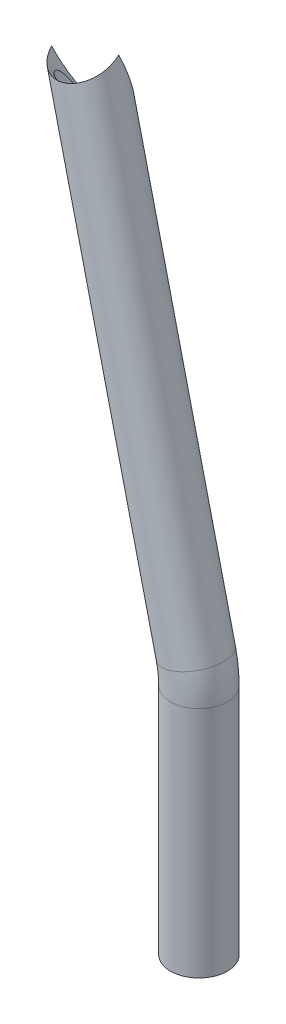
ISO-10303-21;
HEADER;
FILE_DESCRIPTION(('STEP AP214'),'2;1');
FILE_NAME('part.step','',(''),(''),'','','');
FILE_SCHEMA(('AUTOMOTIVE_DESIGN { 1 0 10303 214 1 1 1 1 }'));
ENDSEC;
DATA;
#1=APPLICATION_CONTEXT('core data for automotive mechanical design processes');
#2=APPLICATION_PROTOCOL_DEFINITION('international standard','automotive_design',2000,#1);
#3=PRODUCT_CONTEXT('',#1,'mechanical');
#4=PRODUCT('Part','Part','',(#3));
#5=PRODUCT_RELATED_PRODUCT_CATEGORY('part','',(#4));
#6=PRODUCT_DEFINITION_FORMATION('','',#4);
#7=PRODUCT_DEFINITION_CONTEXT('part definition',#1,'design');
#8=PRODUCT_DEFINITION('design','',#6,#7);
#9=PRODUCT_DEFINITION_SHAPE('','',#8);
#10=(LENGTH_UNIT() NAMED_UNIT(*) SI_UNIT(.MILLI.,.METRE.));
#11=(NAMED_UNIT(*) PLANE_ANGLE_UNIT() SI_UNIT($,.RADIAN.));
#12=(NAMED_UNIT(*) SI_UNIT($,.STERADIAN.) SOLID_ANGLE_UNIT());
#13=UNCERTAINTY_MEASURE_WITH_UNIT(LENGTH_MEASURE(1.E-05),#10,'distance_accuracy_value','');
#14=(GEOMETRIC_REPRESENTATION_CONTEXT(3) GLOBAL_UNCERTAINTY_ASSIGNED_CONTEXT((#13)) GLOBAL_UNIT_ASSIGNED_CONTEXT((#10,
#11,#12)) REPRESENTATION_CONTEXT('',''));
#15=CARTESIAN_POINT('',(0.,0.,0.));
#16=DIRECTION('',(0.,0.,1.));
#17=DIRECTION('',(1.,0.,0.));
#18=AXIS2_PLACEMENT_3D('',#15,#16,#17);
#19=CARTESIAN_POINT('',(58.3805106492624,-246.153846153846,0.));
#20=DIRECTION('',(-0.230769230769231,0.97300851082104,0.));
#21=DIRECTION('',(-0.97300851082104,-0.230769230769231,0.));
#22=AXIS2_PLACEMENT_3D('',#19,#20,#21);
#23=CYLINDRICAL_SURFACE('',#22,15.);
#24=CARTESIAN_POINT('',(58.3805106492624,-246.153846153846,0.));
#25=DIRECTION('',(-0.230769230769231,0.97300851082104,0.));
#26=DIRECTION('',(0.,0.,1.));
#27=AXIS2_PLACEMENT_3D('',#24,#25,#26);
#28=CIRCLE('',#27,15.);
#29=CARTESIAN_POINT('',(72.975638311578,-242.692307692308,0.));
#30=VERTEX_POINT('',#29);
#31=EDGE_CURVE('E11',#30,#30,#28,.T.);
#32=ORIENTED_EDGE('',*,*,#31,.T.);
#33=EDGE_LOOP('',(#32));
#34=FACE_BOUND('',#33,.T.);
#35=CARTESIAN_POINT('',(0.,0.,0.));
#36=DIRECTION('',(-0.298010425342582,0.327244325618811,-0.896716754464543));
#37=DIRECTION('',(-0.125145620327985,0.917898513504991,0.376564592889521));
#38=AXIS2_PLACEMENT_3D('',#35,#36,#37);
#39=ELLIPSE('',#38,38.7413552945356,15.);
#40=CARTESIAN_POINT('',(-14.1948540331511,-3.36660523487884,3.48885198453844));
#41=VERTEX_POINT('',#40);
#42=CARTESIAN_POINT('',(14.1948540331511,3.36660523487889,-3.48885198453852));
#43=VERTEX_POINT('',#42);
#44=EDGE_CURVE('E46',#41,#43,#39,.F.);
#45=ORIENTED_EDGE('',*,*,#44,.T.);
#46=CARTESIAN_POINT('',(0.,0.,0.));
#47=DIRECTION('',(-0.125145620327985,0.917898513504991,0.376564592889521));
#48=DIRECTION('',(-0.298010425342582,0.327244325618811,-0.896716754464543));
#49=AXIS2_PLACEMENT_3D('',#46,#47,#48);
#50=ELLIPSE('',#49,16.268930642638,15.);
#51=EDGE_CURVE('E44',#43,#41,#50,.F.);
#52=ORIENTED_EDGE('',*,*,#51,.T.);
#53=EDGE_LOOP('',(#45,#52));
#54=FACE_BOUND('',#53,.T.);
#55=ADVANCED_FACE('F31',(#34,#54),#23,.T.);
#56=CARTESIAN_POINT('',(58.3805106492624,-246.153846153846,0.));
#57=DIRECTION('',(-0.230769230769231,0.97300851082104,0.));
#58=DIRECTION('',(-0.97300851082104,-0.230769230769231,0.));
#59=AXIS2_PLACEMENT_3D('',#56,#57,#58);
#60=CYLINDRICAL_SURFACE('',#59,13.);
#61=CARTESIAN_POINT('',(58.3805106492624,-246.153846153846,0.));
#62=DIRECTION('',(-0.230769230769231,0.97300851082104,0.));
#63=DIRECTION('',(0.,0.,1.));
#64=AXIS2_PLACEMENT_3D('',#61,#62,#63);
#65=CIRCLE('',#64,13.);
#66=CARTESIAN_POINT('',(71.0296212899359,-243.153846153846,0.));
#67=VERTEX_POINT('',#66);
#68=EDGE_CURVE('E38',#67,#67,#65,.T.);
#69=ORIENTED_EDGE('',*,*,#68,.F.);
#70=EDGE_LOOP('',(#69));
#71=FACE_BOUND('',#70,.T.);
#72=CARTESIAN_POINT('',(-9.35607137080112,-16.8846726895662,0.));
#73=CARTESIAN_POINT('',(-9.25164398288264,-17.3250074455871,-0.309104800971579));
#74=CARTESIAN_POINT('',(-9.13534416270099,-17.767866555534,-0.610672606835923));
#75=CARTESIAN_POINT('',(-8.88233934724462,-18.6551858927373,-1.20279704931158));
#76=CARTESIAN_POINT('',(-8.7456281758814,-19.0996465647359,-1.49335031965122));
#77=CARTESIAN_POINT('',(-8.45343297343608,-19.9882526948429,-2.06669628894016));
#78=CARTESIAN_POINT('',(-8.29792519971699,-20.432397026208,-2.34947860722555));
#79=CARTESIAN_POINT('',(-7.96916656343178,-21.3178058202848,-2.90902688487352));
#80=CARTESIAN_POINT('',(-7.79591773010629,-21.7590706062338,-3.18579352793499));
#81=CARTESIAN_POINT('',(-7.43081976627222,-22.6395008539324,-3.7364708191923));
#82=CARTESIAN_POINT('',(-7.23887240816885,-23.0786409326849,-4.01035697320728));
#83=CARTESIAN_POINT('',(-6.83679636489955,-23.9506115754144,-4.55490929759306));
#84=CARTESIAN_POINT('',(-6.62666636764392,-24.3834416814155,-4.82557523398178));
#85=CARTESIAN_POINT('',(-6.18759669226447,-25.2403557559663,-5.36422562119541));
#86=CARTESIAN_POINT('',(-5.95867926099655,-25.6644493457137,-5.63221283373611));
#87=CARTESIAN_POINT('',(-5.48045788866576,-26.5020643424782,-6.16636841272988));
#88=CARTESIAN_POINT('',(-5.2311571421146,-26.9155873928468,-6.43253705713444));
#89=CARTESIAN_POINT('',(-4.68451038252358,-27.7693743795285,-6.98958538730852));
#90=CARTESIAN_POINT('',(-4.38485052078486,-28.2082691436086,-7.2803212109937));
#91=CARTESIAN_POINT('',(-3.91231584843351,-28.8507532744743,-7.7151938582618));
#92=CARTESIAN_POINT('',(-3.75089515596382,-29.0623520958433,-7.86000318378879));
#93=CARTESIAN_POINT('',(-3.41979518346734,-29.4793549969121,-8.14913045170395));
#94=CARTESIAN_POINT('',(-3.25011603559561,-29.6847591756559,-8.29344840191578));
#95=CARTESIAN_POINT('',(-2.90315695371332,-30.0868185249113,-8.5803999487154));
#96=CARTESIAN_POINT('',(-2.72594357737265,-30.2835277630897,-8.7230380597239));
#97=CARTESIAN_POINT('',(-2.36198252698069,-30.6685800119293,-9.00755709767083));
#98=CARTESIAN_POINT('',(-2.17523384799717,-30.8569221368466,-9.14943794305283));
#99=CARTESIAN_POINT('',(-1.79164786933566,-31.2233850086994,-9.43195470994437));
#100=CARTESIAN_POINT('',(-1.59482444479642,-31.4015191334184,-9.57259204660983));
#101=CARTESIAN_POINT('',(-1.18999968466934,-31.7457925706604,-9.85235406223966));
#102=CARTESIAN_POINT('',(-0.982002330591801,-31.9119361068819,-9.99147925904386));
#103=CARTESIAN_POINT('',(-0.620209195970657,-32.1804386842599,-10.2248036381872));
#104=CARTESIAN_POINT('',(-0.469597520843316,-32.2866055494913,-10.3195610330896));
#105=CARTESIAN_POINT('',(-0.162271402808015,-32.4909777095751,-10.5077737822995));
#106=CARTESIAN_POINT('',(-0.00555720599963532,-32.5891833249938,-10.6012291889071));
#107=CARTESIAN_POINT('',(0.314515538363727,-32.7765532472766,-10.786613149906));
#108=CARTESIAN_POINT('',(0.477883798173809,-32.8657036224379,-10.8785391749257));
#109=CARTESIAN_POINT('',(0.811138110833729,-33.0333016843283,-11.0601771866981));
#110=CARTESIAN_POINT('',(0.981024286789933,-33.1117491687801,-11.1498891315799));
#111=CARTESIAN_POINT('',(1.50487299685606,-33.330244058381,-11.4169331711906));
#112=CARTESIAN_POINT('',(1.86955914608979,-33.45133423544,-11.5901344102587));
#113=CARTESIAN_POINT('',(2.43393422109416,-33.5823797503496,-11.8353536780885));
#114=CARTESIAN_POINT('',(2.62480704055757,-33.6176227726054,-11.914611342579));
#115=CARTESIAN_POINT('',(3.01147035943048,-33.6692105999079,-12.0671818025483));
#116=CARTESIAN_POINT('',(3.2072587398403,-33.6855634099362,-12.1404971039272));
#117=CARTESIAN_POINT('',(3.55106836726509,-33.6959626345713,-12.2618779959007));
#118=CARTESIAN_POINT('',(3.69838379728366,-33.6946748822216,-12.3115784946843));
#119=CARTESIAN_POINT('',(3.99386654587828,-33.6801178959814,-12.4064617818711));
#120=CARTESIAN_POINT('',(4.14203366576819,-33.6668513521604,-12.4516455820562));
#121=CARTESIAN_POINT('',(4.43812832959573,-33.6280428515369,-12.5370107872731));
#122=CARTESIAN_POINT('',(4.58605595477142,-33.6025068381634,-12.5771946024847));
#123=CARTESIAN_POINT('',(4.8806444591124,-33.5391730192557,-12.6522175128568));
#124=CARTESIAN_POINT('',(5.02730529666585,-33.50137481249,-12.6870564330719));
#125=CARTESIAN_POINT('',(5.31813944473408,-33.4138928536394,-12.7511235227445));
#126=CARTESIAN_POINT('',(5.46231478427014,-33.3642193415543,-12.7803564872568));
#127=CARTESIAN_POINT('',(5.74737641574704,-33.2535830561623,-12.8331737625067));
#128=CARTESIAN_POINT('',(5.88826153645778,-33.1926163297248,-12.8567560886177));
#129=CARTESIAN_POINT('',(6.16594879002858,-33.060230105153,-12.8983304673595));
#130=CARTESIAN_POINT('',(6.30274903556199,-32.9888058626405,-12.9163199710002));
#131=CARTESIAN_POINT('',(6.57162620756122,-32.8365080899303,-12.946884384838));
#132=CARTESIAN_POINT('',(6.70370192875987,-32.7556321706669,-12.9594579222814));
#133=CARTESIAN_POINT('',(7.01261428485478,-32.5526972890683,-12.9833121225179));
#134=CARTESIAN_POINT('',(7.18710201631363,-32.4267725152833,-12.9922303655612));
#135=CARTESIAN_POINT('',(7.52578834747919,-32.1614796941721,-13.001092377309));
#136=CARTESIAN_POINT('',(7.68998229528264,-32.0221056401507,-13.0010321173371));
#137=CARTESIAN_POINT('',(8.00841551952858,-31.7320780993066,-12.9928895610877));
#138=CARTESIAN_POINT('',(8.16263422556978,-31.5814026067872,-12.9847912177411));
#139=CARTESIAN_POINT('',(8.46110322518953,-31.2711208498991,-12.9614814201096));
#140=CARTESIAN_POINT('',(8.60535492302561,-31.1115158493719,-12.9462709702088));
#141=CARTESIAN_POINT('',(8.98224413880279,-30.6707358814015,-12.896744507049));
#142=CARTESIAN_POINT('',(9.20606702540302,-30.3826696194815,-12.8565077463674));
#143=CARTESIAN_POINT('',(9.62986109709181,-29.7917688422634,-12.7613872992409));
#144=CARTESIAN_POINT('',(9.82981396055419,-29.4889232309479,-12.7064924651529));
#145=CARTESIAN_POINT('',(10.209132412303,-28.8722772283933,-12.5845720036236));
#146=CARTESIAN_POINT('',(10.3884599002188,-28.5584579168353,-12.5175244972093));
#147=CARTESIAN_POINT('',(10.7287223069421,-27.923442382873,-12.3733600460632));
#148=CARTESIAN_POINT('',(10.8896614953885,-27.6022478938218,-12.2962454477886));
#149=CARTESIAN_POINT('',(11.2045475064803,-26.9352228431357,-12.1285658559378));
#150=CARTESIAN_POINT('',(11.3575098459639,-26.5890628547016,-12.0374737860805));
#151=CARTESIAN_POINT('',(11.6476283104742,-25.8924037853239,-11.8469075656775));
#152=CARTESIAN_POINT('',(11.7847808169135,-25.5419037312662,-11.7474315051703));
#153=CARTESIAN_POINT('',(12.0451895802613,-24.8375805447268,-11.5409677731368));
#154=CARTESIAN_POINT('',(12.1684322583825,-24.4837545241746,-11.433972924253));
#155=CARTESIAN_POINT('',(12.4023700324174,-23.7741096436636,-11.2132615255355));
#156=CARTESIAN_POINT('',(12.5130660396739,-23.4182909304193,-11.0995454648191));
#157=CARTESIAN_POINT('',(12.7235867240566,-22.7040034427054,-10.8654228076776));
#158=CARTESIAN_POINT('',(12.8233674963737,-22.3455297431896,-10.7449919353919));
#159=CARTESIAN_POINT('',(13.0126317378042,-21.6279206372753,-10.4981736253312));
#160=CARTESIAN_POINT('',(13.1021150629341,-21.2687852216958,-10.3717861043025));
#161=CARTESIAN_POINT('',(13.2716346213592,-20.5506126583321,-10.1133253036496));
#162=CARTESIAN_POINT('',(13.3516769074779,-20.1915755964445,-9.98125574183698));
#163=CARTESIAN_POINT('',(13.5031567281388,-19.4738298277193,-9.71140635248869));
#164=CARTESIAN_POINT('',(13.5745940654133,-19.1151211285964,-9.57362639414));
#165=CARTESIAN_POINT('',(13.7215076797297,-18.3348899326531,-9.26732348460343));
#166=CARTESIAN_POINT('',(13.7954510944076,-17.9135166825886,-9.09768377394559));
#167=CARTESIAN_POINT('',(13.9332835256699,-17.0725709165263,-8.7500372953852));
#168=CARTESIAN_POINT('',(13.9971722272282,-16.6529984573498,-8.57203026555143));
#169=CARTESIAN_POINT('',(14.1157665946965,-15.8160297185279,-8.20681690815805));
#170=CARTESIAN_POINT('',(14.1704625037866,-15.3986362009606,-8.01960107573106));
#171=CARTESIAN_POINT('',(14.2712921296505,-14.5674539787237,-7.63515813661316));
#172=CARTESIAN_POINT('',(14.3174262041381,-14.1536651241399,-7.43793144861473));
#173=CARTESIAN_POINT('',(14.4015410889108,-13.3328588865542,-7.03298278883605));
#174=CARTESIAN_POINT('',(14.439559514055,-12.9258187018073,-6.82531500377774));
#175=CARTESIAN_POINT('',(14.5082204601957,-12.1180874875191,-6.39659666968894));
#176=CARTESIAN_POINT('',(14.5388617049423,-11.7173975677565,-6.17554381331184));
#177=CARTESIAN_POINT('',(14.5930752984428,-10.9254769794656,-5.7177189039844));
#178=CARTESIAN_POINT('',(14.6166596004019,-10.5342313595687,-5.48097427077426));
#179=CARTESIAN_POINT('',(14.6569777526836,-9.76409037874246,-4.98777628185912));
#180=CARTESIAN_POINT('',(14.6737148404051,-9.38518925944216,-4.73133230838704));
#181=CARTESIAN_POINT('',(14.6955187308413,-8.77344231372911,-4.2869838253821));
#182=CARTESIAN_POINT('',(14.7026198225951,-8.53553032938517,-4.10616672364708));
#183=CARTESIAN_POINT('',(14.7135627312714,-8.06934550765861,-3.73226097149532));
#184=CARTESIAN_POINT('',(14.7174041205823,-7.84107393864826,-3.53917071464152));
#185=CARTESIAN_POINT('',(14.7213953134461,-7.39746272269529,-3.13936680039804));
#186=CARTESIAN_POINT('',(14.7215522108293,-7.18209902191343,-2.93268009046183));
#187=CARTESIAN_POINT('',(14.717480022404,-6.76748879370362,-2.50372152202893));
#188=CARTESIAN_POINT('',(14.7132523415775,-6.56823712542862,-2.28145467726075));
#189=CARTESIAN_POINT('',(14.7009233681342,-6.23384316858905,-1.87349750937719));
#190=CARTESIAN_POINT('',(14.6939414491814,-6.09451897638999,-1.69120677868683));
#191=CARTESIAN_POINT('',(14.6760588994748,-5.83011865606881,-1.31672241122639));
#192=CARTESIAN_POINT('',(14.6651587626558,-5.70504073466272,-1.12453002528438));
#193=CARTESIAN_POINT('',(14.63865612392,-5.47131874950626,-0.731037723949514));
#194=CARTESIAN_POINT('',(14.6230603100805,-5.3626516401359,-0.529751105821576));
#195=CARTESIAN_POINT('',(14.5862754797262,-5.16313397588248,-0.119002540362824));
#196=CARTESIAN_POINT('',(14.5650865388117,-5.07228318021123,0.090459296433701));
#197=CARTESIAN_POINT('',(14.5161590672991,-4.90903843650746,0.516365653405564));
#198=CARTESIAN_POINT('',(14.488403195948,-4.83669442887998,0.732827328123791));
#199=CARTESIAN_POINT('',(14.4255524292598,-4.71073881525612,1.17007617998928));
#200=CARTESIAN_POINT('',(14.3904573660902,-4.6571276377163,1.39086345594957));
#201=CARTESIAN_POINT('',(14.312169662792,-4.56766209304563,1.8350158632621));
#202=CARTESIAN_POINT('',(14.2689615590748,-4.53184211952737,2.05838514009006));
#203=CARTESIAN_POINT('',(14.1739657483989,-4.47659259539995,2.50531270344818));
#204=CARTESIAN_POINT('',(14.1221767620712,-4.45716549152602,2.72887101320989));
#205=CARTESIAN_POINT('',(13.9926289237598,-4.42919137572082,3.24182384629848));
#206=CARTESIAN_POINT('',(13.9117506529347,-4.42570248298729,3.53070995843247));
#207=CARTESIAN_POINT('',(13.7342591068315,-4.43915015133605,4.10311775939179));
#208=CARTESIAN_POINT('',(13.6376406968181,-4.45609338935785,4.38663766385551));
#209=CARTESIAN_POINT('',(13.4283156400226,-4.50649251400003,4.94647765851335));
#210=CARTESIAN_POINT('',(13.3155917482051,-4.53996619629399,5.22278965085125));
#211=CARTESIAN_POINT('',(13.0740828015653,-4.62001037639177,5.76628288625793));
#212=CARTESIAN_POINT('',(12.9452989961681,-4.66657985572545,6.03346483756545));
#213=CARTESIAN_POINT('',(12.6678084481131,-4.77143000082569,6.56498880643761));
#214=CARTESIAN_POINT('',(12.518635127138,-4.830009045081,6.82902798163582));
#215=CARTESIAN_POINT('',(12.2036035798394,-4.95538694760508,7.34490463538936));
#216=CARTESIAN_POINT('',(12.0377452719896,-5.02218584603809,7.59674205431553));
#217=CARTESIAN_POINT('',(11.6897636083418,-5.16182069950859,8.08702186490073));
#218=CARTESIAN_POINT('',(11.5076456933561,-5.23465463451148,8.32546869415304));
#219=CARTESIAN_POINT('',(11.127592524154,-5.38456730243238,8.78799587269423));
#220=CARTESIAN_POINT('',(10.9296564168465,-5.46164626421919,9.01207544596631));
#221=CARTESIAN_POINT('',(10.4809151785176,-5.63287816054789,9.48448616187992));
#222=CARTESIAN_POINT('',(10.2270666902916,-5.72757263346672,9.72974232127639));
#223=CARTESIAN_POINT('',(9.6993513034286,-5.91857370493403,10.1970368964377));
#224=CARTESIAN_POINT('',(9.42548221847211,-6.01488047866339,10.4190727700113));
#225=CARTESIAN_POINT('',(8.85917223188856,-6.20730694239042,10.8384094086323));
#226=CARTESIAN_POINT('',(8.56672433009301,-6.30342654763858,11.0357007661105));
#227=CARTESIAN_POINT('',(7.96516424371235,-6.49388103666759,11.4039723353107));
#228=CARTESIAN_POINT('',(7.65605263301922,-6.58821598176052,11.574953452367));
#229=CARTESIAN_POINT('',(7.0240595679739,-6.77354355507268,11.8888748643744));
#230=CARTESIAN_POINT('',(6.70121773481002,-6.8645445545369,12.0318899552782));
#231=CARTESIAN_POINT('',(6.04322758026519,-7.04240413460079,12.289348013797));
#232=CARTESIAN_POINT('',(5.70807917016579,-7.12926268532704,12.403790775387));
#233=CARTESIAN_POINT('',(5.02795584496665,-7.29798161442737,12.6032059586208));
#234=CARTESIAN_POINT('',(4.68298231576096,-7.37984269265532,12.6881825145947));
#235=CARTESIAN_POINT('',(3.9857362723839,-7.5379680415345,12.8280532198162));
#236=CARTESIAN_POINT('',(3.63346387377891,-7.61423240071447,12.8829478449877));
#237=CARTESIAN_POINT('',(2.93176606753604,-7.75925081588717,12.9614474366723));
#238=CARTESIAN_POINT('',(2.58243719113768,-7.82812930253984,12.9856876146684));
#239=CARTESIAN_POINT('',(1.88188905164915,-7.9600644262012,13.0048768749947));
#240=CARTESIAN_POINT('',(1.53066981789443,-8.02312115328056,12.9998264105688));
#241=CARTESIAN_POINT('',(0.828969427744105,-8.14354850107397,12.9605528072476));
#242=CARTESIAN_POINT('',(0.478488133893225,-8.20092029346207,12.926335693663));
#243=CARTESIAN_POINT('',(-0.219272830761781,-8.31041961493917,12.8290519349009));
#244=CARTESIAN_POINT('',(-0.566552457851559,-8.36254707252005,12.7659848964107));
#245=CARTESIAN_POINT('',(-1.25937461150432,-8.46287081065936,12.6105959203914));
#246=CARTESIAN_POINT('',(-1.60485087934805,-8.51101480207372,12.5179448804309));
#247=CARTESIAN_POINT('',(-2.28739652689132,-8.60383141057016,12.3042708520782));
#248=CARTESIAN_POINT('',(-2.62446573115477,-8.6485039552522,12.1832472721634));
#249=CARTESIAN_POINT('',(-3.28819485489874,-8.73604233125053,11.9133701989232));
#250=CARTESIAN_POINT('',(-3.61483616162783,-8.77890497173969,11.7644698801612));
#251=CARTESIAN_POINT('',(-4.25448048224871,-8.86490232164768,11.4398590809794));
#252=CARTESIAN_POINT('',(-4.5674836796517,-8.90803702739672,11.2641489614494));
#253=CARTESIAN_POINT('',(-5.18440866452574,-8.99851350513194,10.8824005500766));
#254=CARTESIAN_POINT('',(-5.48793291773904,-9.04593133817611,10.6757362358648));
#255=CARTESIAN_POINT('',(-6.0746024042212,-9.14810666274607,10.2366106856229));
#256=CARTESIAN_POINT('',(-6.35774201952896,-9.20286616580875,10.0041423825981));
#257=CARTESIAN_POINT('',(-6.89889609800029,-9.32472286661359,9.51608628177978));
#258=CARTESIAN_POINT('',(-7.15698755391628,-9.39178029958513,9.26057431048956));
#259=CARTESIAN_POINT('',(-7.64448106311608,-9.54468284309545,8.72874117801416));
#260=CARTESIAN_POINT('',(-7.87390866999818,-9.63051102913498,8.45243890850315));
#261=CARTESIAN_POINT('',(-8.2163831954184,-9.78946154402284,7.9944518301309));
#262=CARTESIAN_POINT('',(-8.33997160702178,-9.85452720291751,7.8177970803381));
#263=CARTESIAN_POINT('',(-8.57352211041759,-9.99572839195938,7.45999418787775));
#264=CARTESIAN_POINT('',(-8.68348905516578,-10.0718599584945,7.27884767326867));
#265=CARTESIAN_POINT('',(-8.88865078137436,-10.2361859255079,6.9142377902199));
#266=CARTESIAN_POINT('',(-8.98387616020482,-10.3243546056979,6.73078009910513));
#267=CARTESIAN_POINT('',(-9.15921986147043,-10.513499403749,6.36322838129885));
#268=CARTESIAN_POINT('',(-9.2393380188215,-10.6144756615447,6.1791343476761));
#269=CARTESIAN_POINT('',(-9.38436535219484,-10.8292300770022,5.81231967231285));
#270=CARTESIAN_POINT('',(-9.44926807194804,-10.9430136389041,5.6295996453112));
#271=CARTESIAN_POINT('',(-9.56424814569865,-11.1826346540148,5.26745563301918));
#272=CARTESIAN_POINT('',(-9.61432523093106,-11.3084723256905,5.08803170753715));
#273=CARTESIAN_POINT('',(-9.70065982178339,-11.5712524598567,4.73351003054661));
#274=CARTESIAN_POINT('',(-9.73688887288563,-11.7082170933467,4.55842187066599));
#275=CARTESIAN_POINT('',(-9.79664467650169,-11.9915698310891,4.21375432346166));
#276=CARTESIAN_POINT('',(-9.82016670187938,-12.1379614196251,4.04417700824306));
#277=CARTESIAN_POINT('',(-9.86725548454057,-12.5342290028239,3.60495500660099));
#278=CARTESIAN_POINT('',(-9.88134000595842,-12.7907170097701,3.34024580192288));
#279=CARTESIAN_POINT('',(-9.8851141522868,-13.3187561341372,2.82609667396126));
#280=CARTESIAN_POINT('',(-9.87478311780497,-13.5903198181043,2.57666986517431));
#281=CARTESIAN_POINT('',(-9.83451871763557,-14.1442233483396,2.0909312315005));
#282=CARTESIAN_POINT('',(-9.80455126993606,-14.4265811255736,1.85464298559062));
#283=CARTESIAN_POINT('',(-9.7286541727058,-14.9981652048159,1.39356322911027));
#284=CARTESIAN_POINT('',(-9.68273039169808,-15.2873889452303,1.16876752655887));
#285=CARTESIAN_POINT('',(-9.59121631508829,-15.7946620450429,0.785760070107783));
#286=CARTESIAN_POINT('',(-9.54864144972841,-16.0116729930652,0.625427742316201));
#287=CARTESIAN_POINT('',(-9.47992254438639,-16.3383653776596,0.38837355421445));
#288=CARTESIAN_POINT('',(-9.45622873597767,-16.4473668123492,0.309993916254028));
#289=CARTESIAN_POINT('',(-9.40729199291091,-16.6657509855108,0.154254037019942));
#290=CARTESIAN_POINT('',(-9.3820490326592,-16.7751337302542,0.0768938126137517));
#291=CARTESIAN_POINT('',(-9.35607137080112,-16.8846726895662,0.));
#292=B_SPLINE_CURVE_WITH_KNOTS('',3,(#72,#73,#74,#75,#76,#77,#78,#79,#80,#81,#82,#83,#84,#85,
#86,#87,#88,#89,#90,#91,#92,#93,#94,#95,#96,#97,#98,#99,#100,#101,#102,#103,#104,#105,#106,#107,
#108,#109,#110,#111,#112,#113,#114,#115,#116,#117,#118,#119,#120,#121,#122,#123,#124,#125,#126,
#127,#128,#129,#130,#131,#132,#133,#134,#135,#136,#137,#138,#139,#140,#141,#142,#143,#144,#145,
#146,#147,#148,#149,#150,#151,#152,#153,#154,#155,#156,#157,#158,#159,#160,#161,#162,#163,#164,
#165,#166,#167,#168,#169,#170,#171,#172,#173,#174,#175,#176,#177,#178,#179,#180,#181,#182,#183,
#184,#185,#186,#187,#188,#189,#190,#191,#192,#193,#194,#195,#196,#197,#198,#199,#200,#201,#202,
#203,#204,#205,#206,#207,#208,#209,#210,#211,#212,#213,#214,#215,#216,#217,#218,#219,#220,#221,
#222,#223,#224,#225,#226,#227,#228,#229,#230,#231,#232,#233,#234,#235,#236,#237,#238,#239,#240,
#241,#242,#243,#244,#245,#246,#247,#248,#249,#250,#251,#252,#253,#254,#255,#256,#257,#258,#259,
#260,#261,#262,#263,#264,#265,#266,#267,#268,#269,#270,#271,#272,#273,#274,#275,#276,#277,#278,
#279,#280,#281,#282,#283,#284,#285,#286,#287,#288,#289,#290,#291),.UNSPECIFIED.,.T.,.F.,(4,2,2,
2,2,2,2,2,2,2,2,2,2,2,2,2,2,2,2,2,2,2,2,2,2,2,2,2,2,2,2,2,2,2,2,2,2,2,2,2,2,2,2,2,2,2,2,2,2,2,2,
2,2,2,2,2,2,2,2,2,2,2,2,2,2,2,2,2,2,2,2,2,2,2,2,2,2,2,2,2,2,2,2,2,2,2,2,2,2,2,2,2,2,2,2,2,2,2,2,
2,2,2,2,2,2,2,2,2,2,4),(0.,1.64408138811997,3.28866125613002,4.93534059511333,6.58183179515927,
8.23749384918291,9.89327547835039,11.5471239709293,13.2007137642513,15.0169112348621,
15.925728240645,16.8345307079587,17.7365165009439,18.6385975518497,19.5394680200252,
20.4400195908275,21.0614236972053,21.6828027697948,22.3051238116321,22.9274566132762,
24.1856572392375,24.8138565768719,25.441789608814,25.907747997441,26.3736017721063,
26.8392301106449,27.3048736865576,27.7701171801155,28.2355238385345,28.7011423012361,
29.1668787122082,29.8119639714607,30.4573386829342,31.1040044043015,31.7505788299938,
32.849763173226,33.9497858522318,35.0518089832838,36.1535757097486,37.3208415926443,
38.4883741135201,39.6570366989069,40.825614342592,41.9987318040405,43.1718656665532,
44.34424327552,45.5166477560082,46.897101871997,48.2775992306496,49.659552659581,
51.0414483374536,52.4167929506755,53.7923753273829,55.165614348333,56.5382033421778,
57.4345988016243,58.3311118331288,59.225898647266,60.1203988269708,60.8084266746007,
61.4963678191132,62.1833337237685,62.8702903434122,63.5590816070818,64.2478886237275,
64.9380220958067,65.6282585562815,66.526961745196,67.4259586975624,68.3259255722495,
69.2258224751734,70.1516087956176,71.0773996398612,72.0028818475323,72.9284140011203,
74.0234597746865,75.1186253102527,76.2142059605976,77.3097489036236,78.402320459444,
79.4948998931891,80.5873259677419,81.6797347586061,82.7491148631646,83.8184784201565,
84.8876211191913,85.9567783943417,87.0382698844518,88.1197839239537,89.2031311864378,
90.2864638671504,91.3957646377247,92.5053699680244,93.6114487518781,94.7165343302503,
95.3915037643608,96.0662320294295,96.739540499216,97.4128563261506,98.0864573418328,
98.7600705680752,99.4350605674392,100.110301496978,101.21490795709,102.32044942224,
103.427914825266,104.534973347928,105.35430533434,105.763285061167,106.1722715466),.UNSPECIFIED.);
#293=CARTESIAN_POINT('',(-9.35607137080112,-16.8846726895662,0.));
#294=VERTEX_POINT('',#293);
#295=EDGE_CURVE('E50',#294,#294,#292,.T.);
#296=ORIENTED_EDGE('',*,*,#295,.F.);
#297=EDGE_LOOP('',(#296));
#298=FACE_BOUND('',#297,.T.);
#299=ADVANCED_FACE('F71',(#71,#298),#60,.F.);
#300=CARTESIAN_POINT('',(0.,-260.,0.));
#301=DIRECTION('',(0.,0.,1.));
#302=DIRECTION('',(1.,0.,0.));
#303=AXIS2_PLACEMENT_3D('',#300,#301,#302);
#304=TOROIDAL_SURFACE('',#303,60.,15.);
#305=CARTESIAN_POINT('',(60.,-260.,0.));
#306=DIRECTION('',(0.,1.,0.));
#307=DIRECTION('',(0.,0.,1.));
#308=AXIS2_PLACEMENT_3D('',#305,#306,#307);
#309=CIRCLE('',#308,15.);
#310=CARTESIAN_POINT('',(75.,-260.,0.));
#311=VERTEX_POINT('',#310);
#312=EDGE_CURVE('E62',#311,#311,#309,.T.);
#313=CARTESIAN_POINT('',(0.,-260.,0.));
#314=DIRECTION('',(0.,0.,1.));
#315=DIRECTION('',(1.,0.,0.));
#316=AXIS2_PLACEMENT_3D('',#313,#314,#315);
#317=CIRCLE('',#316,75.);
#318=EDGE_CURVE('',#311,#30,#317,.T.);
#319=ORIENTED_EDGE('',*,*,#312,.T.);
#320=ORIENTED_EDGE('',*,*,#31,.F.);
#321=ORIENTED_EDGE('',*,*,#318,.T.);
#322=ORIENTED_EDGE('',*,*,#318,.F.);
#323=EDGE_LOOP('',(#319,#321,#320,#322));
#324=FACE_BOUND('',#323,.T.);
#325=ADVANCED_FACE('F74',(#324),#304,.T.);
#326=CARTESIAN_POINT('',(0.,-260.,0.));
#327=DIRECTION('',(0.,0.,1.));
#328=DIRECTION('',(1.,0.,0.));
#329=AXIS2_PLACEMENT_3D('',#326,#327,#328);
#330=TOROIDAL_SURFACE('',#329,60.,13.);
#331=CARTESIAN_POINT('',(60.,-260.,0.));
#332=DIRECTION('',(0.,1.,0.));
#333=DIRECTION('',(0.,0.,1.));
#334=AXIS2_PLACEMENT_3D('',#331,#332,#333);
#335=CIRCLE('',#334,13.);
#336=CARTESIAN_POINT('',(73.,-260.,0.));
#337=VERTEX_POINT('',#336);
#338=EDGE_CURVE('E59',#337,#337,#335,.T.);
#339=CARTESIAN_POINT('',(0.,-260.,0.));
#340=DIRECTION('',(0.,0.,1.));
#341=DIRECTION('',(1.,0.,0.));
#342=AXIS2_PLACEMENT_3D('',#339,#340,#341);
#343=CIRCLE('',#342,73.);
#344=EDGE_CURVE('',#337,#67,#343,.T.);
#345=ORIENTED_EDGE('',*,*,#338,.F.);
#346=ORIENTED_EDGE('',*,*,#68,.T.);
#347=ORIENTED_EDGE('',*,*,#344,.T.);
#348=ORIENTED_EDGE('',*,*,#344,.F.);
#349=EDGE_LOOP('',(#345,#347,#346,#348));
#350=FACE_BOUND('',#349,.T.);
#351=ADVANCED_FACE('F69',(#350),#330,.F.);
#352=CARTESIAN_POINT('',(60.,-260.,0.));
#353=DIRECTION('',(0.,-1.,0.));
#354=DIRECTION('',(1.,0.,0.));
#355=AXIS2_PLACEMENT_3D('',#352,#353,#354);
#356=CYLINDRICAL_SURFACE('',#355,13.);
#357=ORIENTED_EDGE('',*,*,#338,.T.);
#358=EDGE_LOOP('',(#357));
#359=FACE_BOUND('',#358,.T.);
#360=CARTESIAN_POINT('',(60.,-382.98221281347,0.));
#361=DIRECTION('',(0.,1.,0.));
#362=DIRECTION('',(0.,0.,1.));
#363=AXIS2_PLACEMENT_3D('',#360,#361,#362);
#364=CIRCLE('',#363,13.);
#365=CARTESIAN_POINT('',(60.,-382.98221281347,13.));
#366=VERTEX_POINT('',#365);
#367=EDGE_CURVE('E52',#366,#366,#364,.T.);
#368=ORIENTED_EDGE('',*,*,#367,.F.);
#369=EDGE_LOOP('',(#368));
#370=FACE_BOUND('',#369,.T.);
#371=ADVANCED_FACE('F92',(#359,#370),#356,.F.);
#372=CARTESIAN_POINT('',(60.,-260.,0.));
#373=DIRECTION('',(0.,-1.,0.));
#374=DIRECTION('',(1.,0.,0.));
#375=AXIS2_PLACEMENT_3D('',#372,#373,#374);
#376=CYLINDRICAL_SURFACE('',#375,15.);
#377=ORIENTED_EDGE('',*,*,#312,.F.);
#378=EDGE_LOOP('',(#377));
#379=FACE_BOUND('',#378,.T.);
#380=CARTESIAN_POINT('',(60.,-382.98221281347,0.));
#381=DIRECTION('',(0.,1.,0.));
#382=DIRECTION('',(0.,0.,1.));
#383=AXIS2_PLACEMENT_3D('',#380,#381,#382);
#384=CIRCLE('',#383,15.);
#385=CARTESIAN_POINT('',(60.,-382.98221281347,15.));
#386=VERTEX_POINT('',#385);
#387=EDGE_CURVE('E55',#386,#386,#384,.T.);
#388=ORIENTED_EDGE('',*,*,#387,.T.);
#389=EDGE_LOOP('',(#388));
#390=FACE_BOUND('',#389,.T.);
#391=ADVANCED_FACE('F88',(#379,#390),#376,.T.);
#392=CARTESIAN_POINT('',(60.,-382.98221281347,0.));
#393=DIRECTION('',(0.,1.,0.));
#394=DIRECTION('',(0.,0.,1.));
#395=AXIS2_PLACEMENT_3D('',#392,#393,#394);
#396=PLANE('',#395);
#397=ORIENTED_EDGE('',*,*,#367,.T.);
#398=EDGE_LOOP('',(#397));
#399=FACE_BOUND('',#398,.T.);
#400=ORIENTED_EDGE('',*,*,#387,.F.);
#401=EDGE_LOOP('',(#400));
#402=FACE_BOUND('',#401,.T.);
#403=ADVANCED_FACE('F85',(#399,#402),#396,.F.);
#404=CARTESIAN_POINT('',(0.,28.7228037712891,27.7163783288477));
#405=DIRECTION('',(0.,0.719601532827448,0.694387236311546));
#406=DIRECTION('',(0.,-0.694387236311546,0.719601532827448));
#407=AXIS2_PLACEMENT_3D('',#404,#405,#406);
#408=CYLINDRICAL_SURFACE('',#407,15.);
#409=ORIENTED_EDGE('',*,*,#44,.F.);
#410=ORIENTED_EDGE('',*,*,#51,.F.);
#411=EDGE_LOOP('',(#409,#410));
#412=FACE_BOUND('',#411,.T.);
#413=ORIENTED_EDGE('',*,*,#295,.T.);
#414=EDGE_LOOP('',(#413));
#415=FACE_BOUND('',#414,.T.);
#416=ADVANCED_FACE('F47',(#412,#415),#408,.F.);
#417=CLOSED_SHELL('',(#55,#299,#325,#351,#371,#391,#403,#416));
#418=MANIFOLD_SOLID_BREP('B2',#417);
#419=ADVANCED_BREP_SHAPE_REPRESENTATION('',(#18,#418),#14);
#420=SHAPE_DEFINITION_REPRESENTATION(#9,#419);
ENDSEC;
END-ISO-10303-21;
